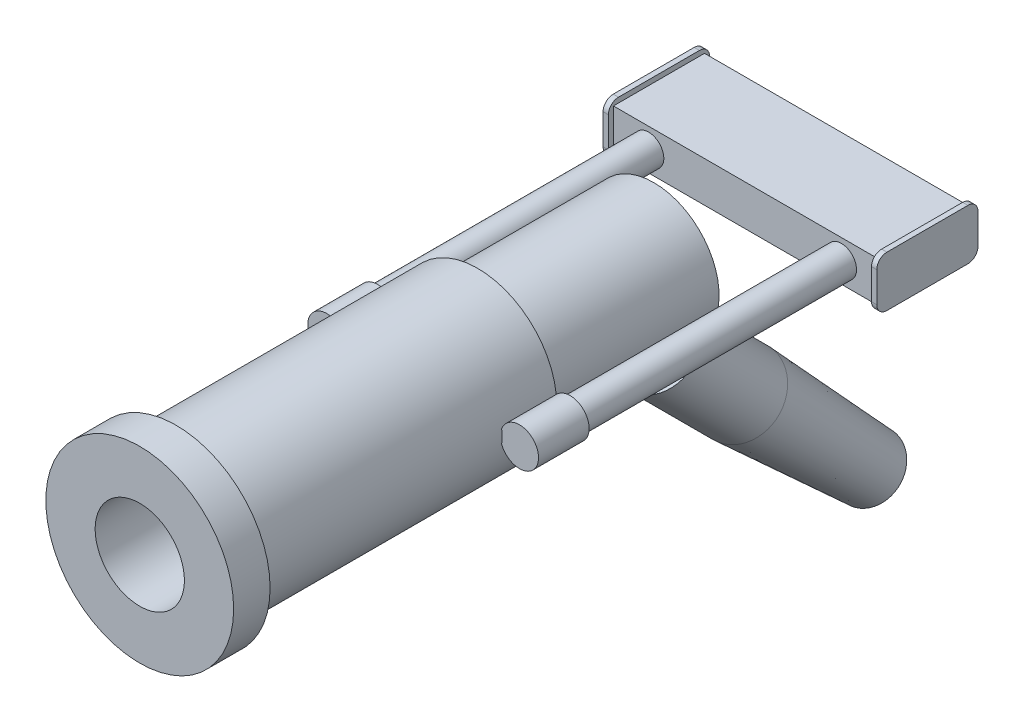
ISO-10303-21;
HEADER;
FILE_DESCRIPTION(('STEP AP214'),'2;1');
FILE_NAME('part.step','',(''),(''),'','','');
FILE_SCHEMA(('AUTOMOTIVE_DESIGN { 1 0 10303 214 1 1 1 1 }'));
ENDSEC;
DATA;
#1=APPLICATION_CONTEXT('core data for automotive mechanical design processes');
#2=APPLICATION_PROTOCOL_DEFINITION('international standard','automotive_design',2000,#1);
#3=PRODUCT_CONTEXT('',#1,'mechanical');
#4=PRODUCT('Part','Part','',(#3));
#5=PRODUCT_RELATED_PRODUCT_CATEGORY('part','',(#4));
#6=PRODUCT_DEFINITION_FORMATION('','',#4);
#7=PRODUCT_DEFINITION_CONTEXT('part definition',#1,'design');
#8=PRODUCT_DEFINITION('design','',#6,#7);
#9=PRODUCT_DEFINITION_SHAPE('','',#8);
#10=(LENGTH_UNIT() NAMED_UNIT(*) SI_UNIT(.MILLI.,.METRE.));
#11=(NAMED_UNIT(*) PLANE_ANGLE_UNIT() SI_UNIT($,.RADIAN.));
#12=(NAMED_UNIT(*) SI_UNIT($,.STERADIAN.) SOLID_ANGLE_UNIT());
#13=UNCERTAINTY_MEASURE_WITH_UNIT(LENGTH_MEASURE(1.E-05),#10,'distance_accuracy_value','');
#14=(GEOMETRIC_REPRESENTATION_CONTEXT(3) GLOBAL_UNCERTAINTY_ASSIGNED_CONTEXT((#13)) GLOBAL_UNIT_ASSIGNED_CONTEXT((#10,
#11,#12)) REPRESENTATION_CONTEXT('',''));
#15=CARTESIAN_POINT('',(0.,0.,0.));
#16=DIRECTION('',(0.,0.,1.));
#17=DIRECTION('',(1.,0.,0.));
#18=AXIS2_PLACEMENT_3D('',#15,#16,#17);
#19=CARTESIAN_POINT('',(0.,-181.25489002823,-457.75929002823));
#20=DIRECTION('',(0.,0.707106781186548,0.707106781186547));
#21=DIRECTION('',(0.,0.707106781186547,-0.707106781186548));
#22=AXIS2_PLACEMENT_3D('',#19,#20,#21);
#23=PLANE('',#22);
#24=CARTESIAN_POINT('',(0.,-181.25489002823,-457.75929002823));
#25=DIRECTION('',(0.,0.707106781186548,0.707106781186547));
#26=DIRECTION('',(0.,-0.707106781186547,0.707106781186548));
#27=AXIS2_PLACEMENT_3D('',#24,#25,#26);
#28=CIRCLE('',#27,19.1395542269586);
#29=CARTESIAN_POINT('',(0.,-194.788598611,-444.22558144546));
#30=VERTEX_POINT('',#29);
#31=EDGE_CURVE('E60',#30,#30,#28,.T.);
#32=ORIENTED_EDGE('',*,*,#31,.F.);
#33=EDGE_LOOP('',(#32));
#34=FACE_BOUND('',#33,.T.);
#35=ADVANCED_FACE('F35',(#34),#23,.F.);
#36=CARTESIAN_POINT('',(0.,-30.8356,-307.34));
#37=DIRECTION('',(0.,-0.707106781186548,-0.707106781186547));
#38=DIRECTION('',(0.,-0.707106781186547,0.707106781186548));
#39=AXIS2_PLACEMENT_3D('',#36,#37,#38);
#40=PLANE('',#39);
#41=CARTESIAN_POINT('',(0.,-30.8356,-307.34));
#42=DIRECTION('',(0.,0.707106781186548,0.707106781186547));
#43=DIRECTION('',(0.,-0.707106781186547,0.707106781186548));
#44=AXIS2_PLACEMENT_3D('',#41,#42,#43);
#45=CIRCLE('',#44,12.573);
#46=CARTESIAN_POINT('',(0.,-39.7260535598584,-298.449546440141));
#47=VERTEX_POINT('',#46);
#48=EDGE_CURVE('E11',#47,#47,#45,.T.);
#49=ORIENTED_EDGE('',*,*,#48,.T.);
#50=EDGE_LOOP('',(#49));
#51=FACE_BOUND('',#50,.T.);
#52=ADVANCED_FACE('F68',(#51),#40,.F.);
#53=CARTESIAN_POINT('',(0.,-30.8356,-307.34));
#54=DIRECTION('',(0.,-0.707106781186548,-0.707106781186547));
#55=DIRECTION('',(0.,-0.707106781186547,0.707106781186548));
#56=AXIS2_PLACEMENT_3D('',#53,#54,#55);
#57=CYLINDRICAL_SURFACE('',#56,12.573);
#58=CARTESIAN_POINT('',(0.,-44.3059841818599,-320.81038418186));
#59=DIRECTION('',(0.,0.707106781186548,0.707106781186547));
#60=DIRECTION('',(0.,-0.707106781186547,0.707106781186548));
#61=AXIS2_PLACEMENT_3D('',#58,#59,#60);
#62=CIRCLE('',#61,12.573);
#63=CARTESIAN_POINT('',(0.,-53.1964377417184,-311.919930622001));
#64=VERTEX_POINT('',#63);
#65=EDGE_CURVE('E41',#64,#64,#62,.T.);
#66=ORIENTED_EDGE('',*,*,#65,.T.);
#67=EDGE_LOOP('',(#66));
#68=FACE_BOUND('',#67,.T.);
#69=ORIENTED_EDGE('',*,*,#48,.F.);
#70=EDGE_LOOP('',(#69));
#71=FACE_BOUND('',#70,.T.);
#72=ADVANCED_FACE('F72',(#68,#71),#57,.T.);
#73=CARTESIAN_POINT('',(0.,-35.4155306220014,-329.700837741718));
#74=DIRECTION('',(0.,-0.707106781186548,-0.707106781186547));
#75=DIRECTION('',(0.,-0.707106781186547,0.707106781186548));
#76=AXIS2_PLACEMENT_3D('',#73,#74,#75);
#77=PLANE('',#76);
#78=CARTESIAN_POINT('',(0.,-44.3059841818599,-320.81038418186));
#79=DIRECTION('',(0.,0.707106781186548,0.707106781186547));
#80=DIRECTION('',(0.,-0.707106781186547,0.707106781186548));
#81=AXIS2_PLACEMENT_3D('',#78,#79,#80);
#82=CIRCLE('',#81,17.4624999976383);
#83=CARTESIAN_POINT('',(0.,-56.65383634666,-308.46253201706));
#84=VERTEX_POINT('',#83);
#85=EDGE_CURVE('E45',#84,#84,#82,.T.);
#86=ORIENTED_EDGE('',*,*,#85,.T.);
#87=EDGE_LOOP('',(#86));
#88=FACE_BOUND('',#87,.T.);
#89=ORIENTED_EDGE('',*,*,#65,.F.);
#90=EDGE_LOOP('',(#89));
#91=FACE_BOUND('',#90,.T.);
#92=ADVANCED_FACE('F76',(#88,#91),#77,.F.);
#93=CARTESIAN_POINT('',(0.,-30.8356,-307.34));
#94=DIRECTION('',(0.,-0.707106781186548,-0.707106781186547));
#95=DIRECTION('',(0.,-0.707106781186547,0.707106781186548));
#96=AXIS2_PLACEMENT_3D('',#93,#94,#95);
#97=CYLINDRICAL_SURFACE('',#96,17.4624999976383);
#98=CARTESIAN_POINT('',(0.,-46.5510482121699,-323.05544821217));
#99=DIRECTION('',(0.,0.707106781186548,0.707106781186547));
#100=DIRECTION('',(0.,-0.707106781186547,0.707106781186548));
#101=AXIS2_PLACEMENT_3D('',#98,#99,#100);
#102=CIRCLE('',#101,17.4624999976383);
#103=CARTESIAN_POINT('',(0.,-58.89890037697,-310.70759604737));
#104=VERTEX_POINT('',#103);
#105=EDGE_CURVE('E49',#104,#104,#102,.T.);
#106=ORIENTED_EDGE('',*,*,#105,.T.);
#107=EDGE_LOOP('',(#106));
#108=FACE_BOUND('',#107,.T.);
#109=ORIENTED_EDGE('',*,*,#85,.F.);
#110=EDGE_LOOP('',(#109));
#111=FACE_BOUND('',#110,.T.);
#112=ADVANCED_FACE('F81',(#108,#111),#97,.T.);
#113=CARTESIAN_POINT('',(0.,-34.2031960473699,-335.40330037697));
#114=DIRECTION('',(0.,-0.707106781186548,-0.707106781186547));
#115=DIRECTION('',(0.,-0.707106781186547,0.707106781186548));
#116=AXIS2_PLACEMENT_3D('',#113,#114,#115);
#117=PLANE('',#116);
#118=CARTESIAN_POINT('',(0.,-46.5510482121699,-323.05544821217));
#119=DIRECTION('',(0.,0.707106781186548,0.707106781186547));
#120=DIRECTION('',(0.,-0.707106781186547,0.707106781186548));
#121=AXIS2_PLACEMENT_3D('',#118,#119,#120);
#122=CIRCLE('',#121,24.1299999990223);
#123=CARTESIAN_POINT('',(0.,-63.61353484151,-305.99296158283));
#124=VERTEX_POINT('',#123);
#125=EDGE_CURVE('E54',#124,#124,#122,.T.);
#126=ORIENTED_EDGE('',*,*,#125,.T.);
#127=EDGE_LOOP('',(#126));
#128=FACE_BOUND('',#127,.T.);
#129=ORIENTED_EDGE('',*,*,#105,.F.);
#130=EDGE_LOOP('',(#129));
#131=FACE_BOUND('',#130,.T.);
#132=ADVANCED_FACE('F85',(#128,#131),#117,.F.);
#133=CARTESIAN_POINT('',(0.,-30.8356,-307.34));
#134=DIRECTION('',(0.,-0.707106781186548,-0.707106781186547));
#135=DIRECTION('',(0.,-0.707106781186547,0.707106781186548));
#136=AXIS2_PLACEMENT_3D('',#133,#134,#135);
#137=CYLINDRICAL_SURFACE('',#136,24.1299999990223);
#138=CARTESIAN_POINT('',(0.,-100.43258493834,-376.93698493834));
#139=DIRECTION('',(0.,0.707106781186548,0.707106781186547));
#140=DIRECTION('',(0.,-0.707106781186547,0.707106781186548));
#141=AXIS2_PLACEMENT_3D('',#138,#139,#140);
#142=CIRCLE('',#141,24.1299999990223);
#143=CARTESIAN_POINT('',(0.,-117.49507156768,-359.874498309));
#144=VERTEX_POINT('',#143);
#145=EDGE_CURVE('E57',#144,#144,#142,.T.);
#146=ORIENTED_EDGE('',*,*,#145,.T.);
#147=EDGE_LOOP('',(#146));
#148=FACE_BOUND('',#147,.T.);
#149=ORIENTED_EDGE('',*,*,#125,.F.);
#150=EDGE_LOOP('',(#149));
#151=FACE_BOUND('',#150,.T.);
#152=ADVANCED_FACE('F89',(#148,#151),#137,.T.);
#153=CARTESIAN_POINT('',(0.,-100.43258493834,-376.93698493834));
#154=DIRECTION('',(0.,0.707106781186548,0.707106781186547));
#155=DIRECTION('',(0.,0.707106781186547,-0.707106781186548));
#156=AXIS2_PLACEMENT_3D('',#153,#154,#155);
#157=CONICAL_SURFACE('',#156,24.1299999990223,0.0436332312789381);
#158=ORIENTED_EDGE('',*,*,#31,.T.);
#159=EDGE_LOOP('',(#158));
#160=FACE_BOUND('',#159,.T.);
#161=ORIENTED_EDGE('',*,*,#145,.F.);
#162=EDGE_LOOP('',(#161));
#163=FACE_BOUND('',#162,.T.);
#164=ADVANCED_FACE('F64',(#160,#163),#157,.T.);
#165=CLOSED_SHELL('',(#35,#52,#72,#92,#112,#132,#152,#164));
#166=MANIFOLD_SOLID_BREP('B2',#165);
#167=CARTESIAN_POINT('',(0.,0.,-322.58));
#168=DIRECTION('',(0.,0.,1.));
#169=DIRECTION('',(-1.,0.,0.));
#170=AXIS2_PLACEMENT_3D('',#167,#168,#169);
#171=CYLINDRICAL_SURFACE('',#170,40.894);
#172=CARTESIAN_POINT('',(0.,0.,-212.09));
#173=DIRECTION('',(0.,0.,1.));
#174=DIRECTION('',(1.,0.,0.));
#175=AXIS2_PLACEMENT_3D('',#172,#173,#174);
#176=CIRCLE('',#175,40.894);
#177=CARTESIAN_POINT('',(40.894,0.,-212.09));
#178=VERTEX_POINT('',#177);
#179=EDGE_CURVE('E133',#178,#178,#176,.T.);
#180=ORIENTED_EDGE('',*,*,#179,.F.);
#181=EDGE_LOOP('',(#180));
#182=FACE_BOUND('',#181,.T.);
#183=CARTESIAN_POINT('',(0.,0.,-339.344));
#184=DIRECTION('',(0.,0.707106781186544,0.707106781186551));
#185=DIRECTION('',(0.,-0.707106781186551,0.707106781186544));
#186=AXIS2_PLACEMENT_3D('',#183,#184,#185);
#187=ELLIPSE('',#186,57.8328494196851,40.894);
#188=CARTESIAN_POINT('',(37.2999670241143,-16.7639999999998,-322.58));
#189=VERTEX_POINT('',#188);
#190=CARTESIAN_POINT('',(-37.2999670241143,-16.7639999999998,-322.58));
#191=VERTEX_POINT('',#190);
#192=EDGE_CURVE('E144',#189,#191,#187,.F.);
#193=ORIENTED_EDGE('',*,*,#192,.F.);
#194=CARTESIAN_POINT('',(0.,0.,-322.58));
#195=DIRECTION('',(0.,0.,1.));
#196=DIRECTION('',(1.,0.,0.));
#197=AXIS2_PLACEMENT_3D('',#194,#195,#196);
#198=CIRCLE('',#197,40.894);
#199=EDGE_CURVE('E33',#189,#191,#198,.T.);
#200=ORIENTED_EDGE('',*,*,#199,.T.);
#201=EDGE_LOOP('',(#193,#200));
#202=FACE_BOUND('',#201,.T.);
#203=ADVANCED_FACE('F126',(#182,#202),#171,.T.);
#204=CARTESIAN_POINT('',(0.,0.,-322.58));
#205=DIRECTION('',(0.,0.,-1.));
#206=DIRECTION('',(1.,0.,0.));
#207=AXIS2_PLACEMENT_3D('',#204,#205,#206);
#208=PLANE('',#207);
#209=ORIENTED_EDGE('',*,*,#199,.F.);
#210=DIRECTION('',(-1.,0.,0.));
#211=VECTOR('',#210,1.);
#212=CARTESIAN_POINT('',(85.853,-16.7639999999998,-322.58));
#213=LINE('',#212,#211);
#214=EDGE_CURVE('E139',#189,#191,#213,.T.);
#215=ORIENTED_EDGE('',*,*,#214,.T.);
#216=EDGE_LOOP('',(#209,#215));
#217=FACE_BOUND('',#216,.T.);
#218=ADVANCED_FACE('F142',(#217),#208,.T.);
#219=CARTESIAN_POINT('',(0.,0.,-212.09));
#220=DIRECTION('',(0.,0.,-1.));
#221=DIRECTION('',(1.,0.,0.));
#222=AXIS2_PLACEMENT_3D('',#219,#220,#221);
#223=PLANE('',#222);
#224=ORIENTED_EDGE('',*,*,#179,.T.);
#225=EDGE_LOOP('',(#224));
#226=FACE_BOUND('',#225,.T.);
#227=ADVANCED_FACE('F152',(#226),#223,.F.);
#228=CARTESIAN_POINT('',(85.853,-14.7848708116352,-324.559129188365));
#229=DIRECTION('',(0.,-0.707106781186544,-0.707106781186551));
#230=DIRECTION('',(0.,-0.707106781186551,0.707106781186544));
#231=AXIS2_PLACEMENT_3D('',#228,#229,#230);
#232=PLANE('',#231);
#233=ORIENTED_EDGE('',*,*,#214,.F.);
#234=ORIENTED_EDGE('',*,*,#192,.T.);
#235=EDGE_LOOP('',(#233,#234));
#236=FACE_BOUND('',#235,.T.);
#237=ADVANCED_FACE('F147',(#236),#232,.T.);
#238=CLOSED_SHELL('',(#203,#218,#227,#237));
#239=MANIFOLD_SOLID_BREP('B6',#238);
#240=CARTESIAN_POINT('',(-60.4519999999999,0.,-209.55));
#241=DIRECTION('',(0.,0.,1.));
#242=DIRECTION('',(1.,0.,0.));
#243=AXIS2_PLACEMENT_3D('',#240,#241,#242);
#244=CYLINDRICAL_SURFACE('',#243,11.938);
#245=CARTESIAN_POINT('',(-60.4519999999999,0.,-209.55));
#246=DIRECTION('',(0.,0.,-1.));
#247=DIRECTION('',(-1.,0.,0.));
#248=AXIS2_PLACEMENT_3D('',#245,#246,#247);
#249=CIRCLE('',#248,11.938);
#250=CARTESIAN_POINT('',(-72.3899999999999,0.,-209.55));
#251=VERTEX_POINT('',#250);
#252=EDGE_CURVE('E125',#251,#251,#249,.T.);
#253=ORIENTED_EDGE('',*,*,#252,.F.);
#254=EDGE_LOOP('',(#253));
#255=FACE_BOUND('',#254,.T.);
#256=CARTESIAN_POINT('',(-60.4519999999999,0.,-177.8));
#257=DIRECTION('',(0.,0.,-1.));
#258=DIRECTION('',(-1.,0.,0.));
#259=AXIS2_PLACEMENT_3D('',#256,#257,#258);
#260=CIRCLE('',#259,11.938);
#261=CARTESIAN_POINT('',(-72.3899999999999,0.,-177.8));
#262=VERTEX_POINT('',#261);
#263=EDGE_CURVE('E184',#262,#262,#260,.T.);
#264=ORIENTED_EDGE('',*,*,#263,.T.);
#265=EDGE_LOOP('',(#264));
#266=FACE_BOUND('',#265,.T.);
#267=ADVANCED_FACE('F178',(#255,#266),#244,.T.);
#268=CARTESIAN_POINT('',(-60.4519999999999,0.,-209.55));
#269=DIRECTION('',(0.,0.,-1.));
#270=DIRECTION('',(-1.,0.,0.));
#271=AXIS2_PLACEMENT_3D('',#268,#269,#270);
#272=PLANE('',#271);
#273=ORIENTED_EDGE('',*,*,#252,.T.);
#274=EDGE_LOOP('',(#273));
#275=FACE_BOUND('',#274,.T.);
#276=ADVANCED_FACE('F193',(#275),#272,.T.);
#277=CARTESIAN_POINT('',(-60.4519999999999,0.,-177.8));
#278=DIRECTION('',(0.,0.,-1.));
#279=DIRECTION('',(-1.,0.,0.));
#280=AXIS2_PLACEMENT_3D('',#277,#278,#279);
#281=PLANE('',#280);
#282=ORIENTED_EDGE('',*,*,#263,.F.);
#283=EDGE_LOOP('',(#282));
#284=FACE_BOUND('',#283,.T.);
#285=ADVANCED_FACE('F191',(#284),#281,.F.);
#286=CLOSED_SHELL('',(#267,#276,#285));
#287=MANIFOLD_SOLID_BREP('B27',#286);
#288=CARTESIAN_POINT('',(-60.4519999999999,0.,-379.73));
#289=DIRECTION('',(0.,0.,1.));
#290=DIRECTION('',(1.,0.,0.));
#291=AXIS2_PLACEMENT_3D('',#288,#289,#290);
#292=CYLINDRICAL_SURFACE('',#291,9.52500000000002);
#293=CARTESIAN_POINT('',(-60.4519999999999,0.,-379.73));
#294=DIRECTION('',(0.,0.,-1.));
#295=DIRECTION('',(-1.,0.,0.));
#296=AXIS2_PLACEMENT_3D('',#293,#294,#295);
#297=CIRCLE('',#296,9.52500000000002);
#298=CARTESIAN_POINT('',(-69.977,0.,-379.73));
#299=VERTEX_POINT('',#298);
#300=EDGE_CURVE('E177',#299,#299,#297,.T.);
#301=ORIENTED_EDGE('',*,*,#300,.F.);
#302=EDGE_LOOP('',(#301));
#303=FACE_BOUND('',#302,.T.);
#304=CARTESIAN_POINT('',(-60.4519999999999,0.,-209.55));
#305=DIRECTION('',(0.,0.,-1.));
#306=DIRECTION('',(-1.,0.,0.));
#307=AXIS2_PLACEMENT_3D('',#304,#305,#306);
#308=CIRCLE('',#307,9.52500000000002);
#309=CARTESIAN_POINT('',(-69.977,0.,-209.55));
#310=VERTEX_POINT('',#309);
#311=EDGE_CURVE('E222',#310,#310,#308,.T.);
#312=ORIENTED_EDGE('',*,*,#311,.T.);
#313=EDGE_LOOP('',(#312));
#314=FACE_BOUND('',#313,.T.);
#315=ADVANCED_FACE('F216',(#303,#314),#292,.T.);
#316=CARTESIAN_POINT('',(-60.4519999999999,0.,-379.73));
#317=DIRECTION('',(0.,0.,-1.));
#318=DIRECTION('',(-1.,0.,0.));
#319=AXIS2_PLACEMENT_3D('',#316,#317,#318);
#320=PLANE('',#319);
#321=ORIENTED_EDGE('',*,*,#300,.T.);
#322=EDGE_LOOP('',(#321));
#323=FACE_BOUND('',#322,.T.);
#324=ADVANCED_FACE('F231',(#323),#320,.T.);
#325=CARTESIAN_POINT('',(-60.4519999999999,0.,-209.55));
#326=DIRECTION('',(0.,0.,-1.));
#327=DIRECTION('',(-1.,0.,0.));
#328=AXIS2_PLACEMENT_3D('',#325,#326,#327);
#329=PLANE('',#328);
#330=ORIENTED_EDGE('',*,*,#311,.F.);
#331=EDGE_LOOP('',(#330));
#332=FACE_BOUND('',#331,.T.);
#333=ADVANCED_FACE('F229',(#332),#329,.F.);
#334=CLOSED_SHELL('',(#315,#324,#333));
#335=MANIFOLD_SOLID_BREP('B120',#334);
#336=CARTESIAN_POINT('',(-85.852,9.52500000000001,-433.705));
#337=DIRECTION('',(1.,0.,0.));
#338=DIRECTION('',(0.,0.,-1.));
#339=AXIS2_PLACEMENT_3D('',#336,#337,#338);
#340=CYLINDRICAL_SURFACE('',#339,6.34999999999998);
#341=CARTESIAN_POINT('',(-82.5500000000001,9.52500000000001,-433.705));
#342=DIRECTION('',(-1.,0.,0.));
#343=DIRECTION('',(0.,0.,-1.));
#344=AXIS2_PLACEMENT_3D('',#341,#342,#343);
#345=CIRCLE('',#344,6.34999999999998);
#346=CARTESIAN_POINT('',(-82.5500000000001,15.875,-433.705));
#347=VERTEX_POINT('',#346);
#348=CARTESIAN_POINT('',(-82.5500000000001,9.52500000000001,-440.055));
#349=VERTEX_POINT('',#348);
#350=EDGE_CURVE('E320',#347,#349,#345,.T.);
#351=ORIENTED_EDGE('',*,*,#350,.T.);
#352=DIRECTION('',(1.,0.,0.));
#353=VECTOR('',#352,1.);
#354=CARTESIAN_POINT('',(-85.852,9.52500000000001,-440.055));
#355=LINE('',#354,#353);
#356=CARTESIAN_POINT('',(-85.852,9.52500000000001,-440.055));
#357=VERTEX_POINT('',#356);
#358=EDGE_CURVE('E214',#357,#349,#355,.T.);
#359=ORIENTED_EDGE('',*,*,#358,.F.);
#360=CARTESIAN_POINT('',(-85.852,9.52500000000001,-433.705));
#361=DIRECTION('',(-1.,0.,0.));
#362=DIRECTION('',(0.,0.,-1.));
#363=AXIS2_PLACEMENT_3D('',#360,#361,#362);
#364=CIRCLE('',#363,6.34999999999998);
#365=CARTESIAN_POINT('',(-85.852,15.875,-433.705));
#366=VERTEX_POINT('',#365);
#367=EDGE_CURVE('E352',#366,#357,#364,.T.);
#368=ORIENTED_EDGE('',*,*,#367,.F.);
#369=DIRECTION('',(1.,0.,0.));
#370=VECTOR('',#369,1.);
#371=CARTESIAN_POINT('',(-85.852,15.875,-433.705));
#372=LINE('',#371,#370);
#373=EDGE_CURVE('E334',#366,#347,#372,.T.);
#374=ORIENTED_EDGE('',*,*,#373,.T.);
#375=EDGE_LOOP('',(#351,#359,#368,#374));
#376=FACE_BOUND('',#375,.T.);
#377=ADVANCED_FACE('F254',(#376),#340,.T.);
#378=CARTESIAN_POINT('',(-85.852,9.52500000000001,-440.055));
#379=DIRECTION('',(0.,0.,1.));
#380=DIRECTION('',(1.,0.,0.));
#381=AXIS2_PLACEMENT_3D('',#378,#379,#380);
#382=PLANE('',#381);
#383=DIRECTION('',(0.,-1.,0.));
#384=VECTOR('',#383,1.);
#385=CARTESIAN_POINT('',(-82.5500000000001,9.52500000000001,-440.055));
#386=LINE('',#385,#384);
#387=CARTESIAN_POINT('',(-82.5500000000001,-9.52500000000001,-440.055));
#388=VERTEX_POINT('',#387);
#389=EDGE_CURVE('E317',#349,#388,#386,.T.);
#390=ORIENTED_EDGE('',*,*,#389,.T.);
#391=DIRECTION('',(1.,0.,0.));
#392=VECTOR('',#391,1.);
#393=CARTESIAN_POINT('',(-85.852,-9.52500000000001,-440.055));
#394=LINE('',#393,#392);
#395=CARTESIAN_POINT('',(-85.852,-9.52500000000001,-440.055));
#396=VERTEX_POINT('',#395);
#397=EDGE_CURVE('E261',#396,#388,#394,.T.);
#398=ORIENTED_EDGE('',*,*,#397,.F.);
#399=DIRECTION('',(0.,-1.,0.));
#400=VECTOR('',#399,1.);
#401=CARTESIAN_POINT('',(-85.852,9.52500000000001,-440.055));
#402=LINE('',#401,#400);
#403=EDGE_CURVE('E330',#357,#396,#402,.T.);
#404=ORIENTED_EDGE('',*,*,#403,.F.);
#405=ORIENTED_EDGE('',*,*,#358,.T.);
#406=EDGE_LOOP('',(#390,#398,#404,#405));
#407=FACE_BOUND('',#406,.T.);
#408=ADVANCED_FACE('F328',(#407),#382,.F.);
#409=CARTESIAN_POINT('',(-85.852,-9.52500000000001,-433.705));
#410=DIRECTION('',(1.,0.,0.));
#411=DIRECTION('',(0.,0.,-1.));
#412=AXIS2_PLACEMENT_3D('',#409,#410,#411);
#413=CYLINDRICAL_SURFACE('',#412,6.34999999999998);
#414=CARTESIAN_POINT('',(-82.5500000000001,-9.52500000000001,-433.705));
#415=DIRECTION('',(-1.,0.,0.));
#416=DIRECTION('',(0.,0.,1.));
#417=AXIS2_PLACEMENT_3D('',#414,#415,#416);
#418=CIRCLE('',#417,6.34999999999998);
#419=CARTESIAN_POINT('',(-82.5500000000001,-15.875,-433.705));
#420=VERTEX_POINT('',#419);
#421=EDGE_CURVE('E322',#388,#420,#418,.T.);
#422=ORIENTED_EDGE('',*,*,#421,.T.);
#423=DIRECTION('',(1.,0.,0.));
#424=VECTOR('',#423,1.);
#425=CARTESIAN_POINT('',(-85.852,-15.875,-433.705));
#426=LINE('',#425,#424);
#427=CARTESIAN_POINT('',(-85.852,-15.875,-433.705));
#428=VERTEX_POINT('',#427);
#429=EDGE_CURVE('E382',#428,#420,#426,.T.);
#430=ORIENTED_EDGE('',*,*,#429,.F.);
#431=CARTESIAN_POINT('',(-85.852,-9.52500000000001,-433.705));
#432=DIRECTION('',(-1.,0.,0.));
#433=DIRECTION('',(0.,0.,1.));
#434=AXIS2_PLACEMENT_3D('',#431,#432,#433);
#435=CIRCLE('',#434,6.34999999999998);
#436=EDGE_CURVE('E355',#396,#428,#435,.T.);
#437=ORIENTED_EDGE('',*,*,#436,.F.);
#438=ORIENTED_EDGE('',*,*,#397,.T.);
#439=EDGE_LOOP('',(#422,#430,#437,#438));
#440=FACE_BOUND('',#439,.T.);
#441=ADVANCED_FACE('F385',(#440),#413,.T.);
#442=CARTESIAN_POINT('',(-85.852,-15.875,-433.705));
#443=DIRECTION('',(0.,1.,0.));
#444=DIRECTION('',(0.,0.,-1.));
#445=AXIS2_PLACEMENT_3D('',#442,#443,#444);
#446=PLANE('',#445);
#447=DIRECTION('',(0.,0.,1.));
#448=VECTOR('',#447,1.);
#449=CARTESIAN_POINT('',(-82.5500000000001,-15.875,-433.705));
#450=LINE('',#449,#448);
#451=CARTESIAN_POINT('',(-82.5500000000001,-15.875,-382.905));
#452=VERTEX_POINT('',#451);
#453=EDGE_CURVE('E338',#420,#452,#450,.T.);
#454=ORIENTED_EDGE('',*,*,#453,.T.);
#455=DIRECTION('',(1.,0.,0.));
#456=VECTOR('',#455,1.);
#457=CARTESIAN_POINT('',(-85.852,-15.875,-382.905));
#458=LINE('',#457,#456);
#459=CARTESIAN_POINT('',(-85.852,-15.875,-382.905));
#460=VERTEX_POINT('',#459);
#461=EDGE_CURVE('E379',#460,#452,#458,.T.);
#462=ORIENTED_EDGE('',*,*,#461,.F.);
#463=DIRECTION('',(0.,0.,1.));
#464=VECTOR('',#463,1.);
#465=CARTESIAN_POINT('',(-85.852,-15.875,-433.705));
#466=LINE('',#465,#464);
#467=EDGE_CURVE('E358',#428,#460,#466,.T.);
#468=ORIENTED_EDGE('',*,*,#467,.F.);
#469=ORIENTED_EDGE('',*,*,#429,.T.);
#470=EDGE_LOOP('',(#454,#462,#468,#469));
#471=FACE_BOUND('',#470,.T.);
#472=ADVANCED_FACE('F405',(#471),#446,.F.);
#473=CARTESIAN_POINT('',(-85.852,-9.52500000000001,-382.905));
#474=DIRECTION('',(1.,0.,0.));
#475=DIRECTION('',(0.,0.,-1.));
#476=AXIS2_PLACEMENT_3D('',#473,#474,#475);
#477=CYLINDRICAL_SURFACE('',#476,6.35000000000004);
#478=CARTESIAN_POINT('',(-82.5500000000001,-9.52500000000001,-382.905));
#479=DIRECTION('',(-1.,0.,0.));
#480=DIRECTION('',(0.,0.,-1.));
#481=AXIS2_PLACEMENT_3D('',#478,#479,#480);
#482=CIRCLE('',#481,6.35000000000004);
#483=CARTESIAN_POINT('',(-82.5500000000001,-9.52500000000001,-376.555));
#484=VERTEX_POINT('',#483);
#485=EDGE_CURVE('E341',#452,#484,#482,.T.);
#486=ORIENTED_EDGE('',*,*,#485,.T.);
#487=DIRECTION('',(1.,0.,0.));
#488=VECTOR('',#487,1.);
#489=CARTESIAN_POINT('',(-85.852,-9.52500000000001,-376.555));
#490=LINE('',#489,#488);
#491=CARTESIAN_POINT('',(-85.852,-9.52500000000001,-376.555));
#492=VERTEX_POINT('',#491);
#493=EDGE_CURVE('E376',#492,#484,#490,.T.);
#494=ORIENTED_EDGE('',*,*,#493,.F.);
#495=CARTESIAN_POINT('',(-85.852,-9.52500000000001,-382.905));
#496=DIRECTION('',(-1.,0.,0.));
#497=DIRECTION('',(0.,0.,-1.));
#498=AXIS2_PLACEMENT_3D('',#495,#496,#497);
#499=CIRCLE('',#498,6.35000000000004);
#500=EDGE_CURVE('E361',#460,#492,#499,.T.);
#501=ORIENTED_EDGE('',*,*,#500,.F.);
#502=ORIENTED_EDGE('',*,*,#461,.T.);
#503=EDGE_LOOP('',(#486,#494,#501,#502));
#504=FACE_BOUND('',#503,.T.);
#505=ADVANCED_FACE('F410',(#504),#477,.T.);
#506=CARTESIAN_POINT('',(-85.852,-9.52500000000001,-376.555));
#507=DIRECTION('',(0.,0.,-1.));
#508=DIRECTION('',(-1.,0.,0.));
#509=AXIS2_PLACEMENT_3D('',#506,#507,#508);
#510=PLANE('',#509);
#511=DIRECTION('',(0.,1.,0.));
#512=VECTOR('',#511,1.);
#513=CARTESIAN_POINT('',(-82.5500000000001,-9.52500000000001,-376.555));
#514=LINE('',#513,#512);
#515=CARTESIAN_POINT('',(-82.5500000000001,9.52500000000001,-376.555));
#516=VERTEX_POINT('',#515);
#517=EDGE_CURVE('E344',#484,#516,#514,.T.);
#518=ORIENTED_EDGE('',*,*,#517,.T.);
#519=DIRECTION('',(1.,0.,0.));
#520=VECTOR('',#519,1.);
#521=CARTESIAN_POINT('',(-85.852,9.52500000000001,-376.555));
#522=LINE('',#521,#520);
#523=CARTESIAN_POINT('',(-85.852,9.52500000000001,-376.555));
#524=VERTEX_POINT('',#523);
#525=EDGE_CURVE('E373',#524,#516,#522,.T.);
#526=ORIENTED_EDGE('',*,*,#525,.F.);
#527=DIRECTION('',(0.,1.,0.));
#528=VECTOR('',#527,1.);
#529=CARTESIAN_POINT('',(-85.852,-9.52500000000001,-376.555));
#530=LINE('',#529,#528);
#531=EDGE_CURVE('E364',#492,#524,#530,.T.);
#532=ORIENTED_EDGE('',*,*,#531,.F.);
#533=ORIENTED_EDGE('',*,*,#493,.T.);
#534=EDGE_LOOP('',(#518,#526,#532,#533));
#535=FACE_BOUND('',#534,.T.);
#536=ADVANCED_FACE('F414',(#535),#510,.F.);
#537=CARTESIAN_POINT('',(-85.852,9.52500000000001,-382.905));
#538=DIRECTION('',(1.,0.,0.));
#539=DIRECTION('',(0.,0.,-1.));
#540=AXIS2_PLACEMENT_3D('',#537,#538,#539);
#541=CYLINDRICAL_SURFACE('',#540,6.35000000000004);
#542=CARTESIAN_POINT('',(-82.5500000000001,9.52500000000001,-382.905));
#543=DIRECTION('',(-1.,0.,0.));
#544=DIRECTION('',(0.,0.,-1.));
#545=AXIS2_PLACEMENT_3D('',#542,#543,#544);
#546=CIRCLE('',#545,6.35000000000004);
#547=CARTESIAN_POINT('',(-82.5500000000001,15.8750000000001,-382.905));
#548=VERTEX_POINT('',#547);
#549=EDGE_CURVE('E347',#516,#548,#546,.T.);
#550=ORIENTED_EDGE('',*,*,#549,.T.);
#551=DIRECTION('',(1.,0.,0.));
#552=VECTOR('',#551,1.);
#553=CARTESIAN_POINT('',(-85.852,15.8750000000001,-382.905));
#554=LINE('',#553,#552);
#555=CARTESIAN_POINT('',(-85.852,15.8750000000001,-382.905));
#556=VERTEX_POINT('',#555);
#557=EDGE_CURVE('E371',#556,#548,#554,.T.);
#558=ORIENTED_EDGE('',*,*,#557,.F.);
#559=CARTESIAN_POINT('',(-85.852,9.52500000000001,-382.905));
#560=DIRECTION('',(-1.,0.,0.));
#561=DIRECTION('',(0.,0.,-1.));
#562=AXIS2_PLACEMENT_3D('',#559,#560,#561);
#563=CIRCLE('',#562,6.35000000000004);
#564=EDGE_CURVE('E367',#524,#556,#563,.T.);
#565=ORIENTED_EDGE('',*,*,#564,.F.);
#566=ORIENTED_EDGE('',*,*,#525,.T.);
#567=EDGE_LOOP('',(#550,#558,#565,#566));
#568=FACE_BOUND('',#567,.T.);
#569=ADVANCED_FACE('F396',(#568),#541,.T.);
#570=CARTESIAN_POINT('',(-85.852,15.875,-382.905));
#571=DIRECTION('',(0.,-1.,0.));
#572=DIRECTION('',(0.,0.,1.));
#573=AXIS2_PLACEMENT_3D('',#570,#571,#572);
#574=PLANE('',#573);
#575=DIRECTION('',(0.,0.,-1.));
#576=VECTOR('',#575,1.);
#577=CARTESIAN_POINT('',(-82.5500000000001,15.875,-382.905));
#578=LINE('',#577,#576);
#579=EDGE_CURVE('E350',#548,#347,#578,.T.);
#580=ORIENTED_EDGE('',*,*,#579,.T.);
#581=ORIENTED_EDGE('',*,*,#373,.F.);
#582=DIRECTION('',(0.,0.,-1.));
#583=VECTOR('',#582,1.);
#584=CARTESIAN_POINT('',(-85.852,15.875,-382.905));
#585=LINE('',#584,#583);
#586=EDGE_CURVE('E268',#556,#366,#585,.T.);
#587=ORIENTED_EDGE('',*,*,#586,.F.);
#588=ORIENTED_EDGE('',*,*,#557,.T.);
#589=EDGE_LOOP('',(#580,#581,#587,#588));
#590=FACE_BOUND('',#589,.T.);
#591=ADVANCED_FACE('F389',(#590),#574,.F.);
#592=CARTESIAN_POINT('',(-85.852,9.52500000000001,-433.705));
#593=DIRECTION('',(1.,0.,0.));
#594=DIRECTION('',(0.,0.,-1.));
#595=AXIS2_PLACEMENT_3D('',#592,#593,#594);
#596=PLANE('',#595);
#597=ORIENTED_EDGE('',*,*,#367,.T.);
#598=ORIENTED_EDGE('',*,*,#403,.T.);
#599=ORIENTED_EDGE('',*,*,#436,.T.);
#600=ORIENTED_EDGE('',*,*,#467,.T.);
#601=ORIENTED_EDGE('',*,*,#500,.T.);
#602=ORIENTED_EDGE('',*,*,#531,.T.);
#603=ORIENTED_EDGE('',*,*,#564,.T.);
#604=ORIENTED_EDGE('',*,*,#586,.T.);
#605=EDGE_LOOP('',(#597,#598,#599,#600,#601,#602,#603,#604));
#606=FACE_BOUND('',#605,.T.);
#607=ADVANCED_FACE('F387',(#606),#596,.F.);
#608=CARTESIAN_POINT('',(-82.5500000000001,9.52500000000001,-433.705));
#609=DIRECTION('',(1.,0.,0.));
#610=DIRECTION('',(0.,0.,-1.));
#611=AXIS2_PLACEMENT_3D('',#608,#609,#610);
#612=PLANE('',#611);
#613=ORIENTED_EDGE('',*,*,#350,.F.);
#614=ORIENTED_EDGE('',*,*,#579,.F.);
#615=ORIENTED_EDGE('',*,*,#549,.F.);
#616=ORIENTED_EDGE('',*,*,#517,.F.);
#617=ORIENTED_EDGE('',*,*,#485,.F.);
#618=ORIENTED_EDGE('',*,*,#453,.F.);
#619=ORIENTED_EDGE('',*,*,#421,.F.);
#620=ORIENTED_EDGE('',*,*,#389,.F.);
#621=EDGE_LOOP('',(#613,#614,#615,#616,#617,#618,#619,#620));
#622=FACE_BOUND('',#621,.T.);
#623=ADVANCED_FACE('F318',(#622),#612,.T.);
#624=CLOSED_SHELL('',(#377,#408,#441,#472,#505,#536,#569,#591,#607,#623));
#625=MANIFOLD_SOLID_BREP('B172',#624);
#626=CARTESIAN_POINT('',(85.852,9.52500000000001,-433.705));
#627=DIRECTION('',(-1.,0.,0.));
#628=DIRECTION('',(0.,0.,-1.));
#629=AXIS2_PLACEMENT_3D('',#626,#627,#628);
#630=CYLINDRICAL_SURFACE('',#629,6.34999999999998);
#631=CARTESIAN_POINT('',(82.5500000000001,9.52500000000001,-433.705));
#632=DIRECTION('',(-1.,0.,0.));
#633=DIRECTION('',(0.,0.,-1.));
#634=AXIS2_PLACEMENT_3D('',#631,#632,#633);
#635=CIRCLE('',#634,6.34999999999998);
#636=CARTESIAN_POINT('',(82.5500000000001,15.875,-433.705));
#637=VERTEX_POINT('',#636);
#638=CARTESIAN_POINT('',(82.5500000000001,9.52500000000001,-440.055));
#639=VERTEX_POINT('',#638);
#640=EDGE_CURVE('E523',#637,#639,#635,.T.);
#641=ORIENTED_EDGE('',*,*,#640,.F.);
#642=DIRECTION('',(-1.,0.,0.));
#643=VECTOR('',#642,1.);
#644=CARTESIAN_POINT('',(85.852,15.875,-433.705));
#645=LINE('',#644,#643);
#646=CARTESIAN_POINT('',(85.852,15.875,-433.705));
#647=VERTEX_POINT('',#646);
#648=EDGE_CURVE('E566',#647,#637,#645,.T.);
#649=ORIENTED_EDGE('',*,*,#648,.F.);
#650=CARTESIAN_POINT('',(85.852,9.52500000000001,-433.705));
#651=DIRECTION('',(-1.,0.,0.));
#652=DIRECTION('',(0.,0.,-1.));
#653=AXIS2_PLACEMENT_3D('',#650,#651,#652);
#654=CIRCLE('',#653,6.34999999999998);
#655=CARTESIAN_POINT('',(85.852,9.52500000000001,-440.055));
#656=VERTEX_POINT('',#655);
#657=EDGE_CURVE('E528',#647,#656,#654,.T.);
#658=ORIENTED_EDGE('',*,*,#657,.T.);
#659=DIRECTION('',(-1.,0.,0.));
#660=VECTOR('',#659,1.);
#661=CARTESIAN_POINT('',(85.852,9.52500000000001,-440.055));
#662=LINE('',#661,#660);
#663=EDGE_CURVE('E252',#656,#639,#662,.T.);
#664=ORIENTED_EDGE('',*,*,#663,.T.);
#665=EDGE_LOOP('',(#641,#649,#658,#664));
#666=FACE_BOUND('',#665,.T.);
#667=ADVANCED_FACE('F451',(#666),#630,.T.);
#668=CARTESIAN_POINT('',(85.852,9.52500000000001,-440.055));
#669=DIRECTION('',(0.,0.,1.));
#670=DIRECTION('',(-1.,0.,0.));
#671=AXIS2_PLACEMENT_3D('',#668,#669,#670);
#672=PLANE('',#671);
#673=DIRECTION('',(0.,-1.,0.));
#674=VECTOR('',#673,1.);
#675=CARTESIAN_POINT('',(82.5500000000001,9.52500000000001,-440.055));
#676=LINE('',#675,#674);
#677=CARTESIAN_POINT('',(82.5500000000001,-9.52500000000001,-440.055));
#678=VERTEX_POINT('',#677);
#679=EDGE_CURVE('E514',#639,#678,#676,.T.);
#680=ORIENTED_EDGE('',*,*,#679,.F.);
#681=ORIENTED_EDGE('',*,*,#663,.F.);
#682=DIRECTION('',(0.,-1.,0.));
#683=VECTOR('',#682,1.);
#684=CARTESIAN_POINT('',(85.852,9.52500000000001,-440.055));
#685=LINE('',#684,#683);
#686=CARTESIAN_POINT('',(85.852,-9.52500000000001,-440.055));
#687=VERTEX_POINT('',#686);
#688=EDGE_CURVE('E548',#656,#687,#685,.T.);
#689=ORIENTED_EDGE('',*,*,#688,.T.);
#690=DIRECTION('',(-1.,0.,0.));
#691=VECTOR('',#690,1.);
#692=CARTESIAN_POINT('',(85.852,-9.52500000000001,-440.055));
#693=LINE('',#692,#691);
#694=EDGE_CURVE('E458',#687,#678,#693,.T.);
#695=ORIENTED_EDGE('',*,*,#694,.T.);
#696=EDGE_LOOP('',(#680,#681,#689,#695));
#697=FACE_BOUND('',#696,.T.);
#698=ADVANCED_FACE('F515',(#697),#672,.F.);
#699=CARTESIAN_POINT('',(85.852,-9.52500000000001,-433.705));
#700=DIRECTION('',(-1.,0.,0.));
#701=DIRECTION('',(0.,0.,-1.));
#702=AXIS2_PLACEMENT_3D('',#699,#700,#701);
#703=CYLINDRICAL_SURFACE('',#702,6.34999999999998);
#704=CARTESIAN_POINT('',(82.5500000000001,-9.52500000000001,-433.705));
#705=DIRECTION('',(-1.,0.,0.));
#706=DIRECTION('',(0.,0.,1.));
#707=AXIS2_PLACEMENT_3D('',#704,#705,#706);
#708=CIRCLE('',#707,6.34999999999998);
#709=CARTESIAN_POINT('',(82.5500000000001,-15.875,-433.705));
#710=VERTEX_POINT('',#709);
#711=EDGE_CURVE('E522',#678,#710,#708,.T.);
#712=ORIENTED_EDGE('',*,*,#711,.F.);
#713=ORIENTED_EDGE('',*,*,#694,.F.);
#714=CARTESIAN_POINT('',(85.852,-9.52500000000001,-433.705));
#715=DIRECTION('',(-1.,0.,0.));
#716=DIRECTION('',(0.,0.,1.));
#717=AXIS2_PLACEMENT_3D('',#714,#715,#716);
#718=CIRCLE('',#717,6.34999999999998);
#719=CARTESIAN_POINT('',(85.852,-15.875,-433.705));
#720=VERTEX_POINT('',#719);
#721=EDGE_CURVE('E550',#687,#720,#718,.T.);
#722=ORIENTED_EDGE('',*,*,#721,.T.);
#723=DIRECTION('',(-1.,0.,0.));
#724=VECTOR('',#723,1.);
#725=CARTESIAN_POINT('',(85.852,-15.875,-433.705));
#726=LINE('',#725,#724);
#727=EDGE_CURVE('E580',#720,#710,#726,.T.);
#728=ORIENTED_EDGE('',*,*,#727,.T.);
#729=EDGE_LOOP('',(#712,#713,#722,#728));
#730=FACE_BOUND('',#729,.T.);
#731=ADVANCED_FACE('F584',(#730),#703,.T.);
#732=CARTESIAN_POINT('',(85.852,-15.875,-433.705));
#733=DIRECTION('',(0.,1.,0.));
#734=DIRECTION('',(0.,0.,-1.));
#735=AXIS2_PLACEMENT_3D('',#732,#733,#734);
#736=PLANE('',#735);
#737=DIRECTION('',(0.,0.,1.));
#738=VECTOR('',#737,1.);
#739=CARTESIAN_POINT('',(82.5500000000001,-15.875,-433.705));
#740=LINE('',#739,#738);
#741=CARTESIAN_POINT('',(82.5500000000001,-15.875,-382.905));
#742=VERTEX_POINT('',#741);
#743=EDGE_CURVE('E535',#710,#742,#740,.T.);
#744=ORIENTED_EDGE('',*,*,#743,.F.);
#745=ORIENTED_EDGE('',*,*,#727,.F.);
#746=DIRECTION('',(0.,0.,1.));
#747=VECTOR('',#746,1.);
#748=CARTESIAN_POINT('',(85.852,-15.875,-433.705));
#749=LINE('',#748,#747);
#750=CARTESIAN_POINT('',(85.852,-15.875,-382.905));
#751=VERTEX_POINT('',#750);
#752=EDGE_CURVE('E553',#720,#751,#749,.T.);
#753=ORIENTED_EDGE('',*,*,#752,.T.);
#754=DIRECTION('',(-1.,0.,0.));
#755=VECTOR('',#754,1.);
#756=CARTESIAN_POINT('',(85.852,-15.875,-382.905));
#757=LINE('',#756,#755);
#758=EDGE_CURVE('E577',#751,#742,#757,.T.);
#759=ORIENTED_EDGE('',*,*,#758,.T.);
#760=EDGE_LOOP('',(#744,#745,#753,#759));
#761=FACE_BOUND('',#760,.T.);
#762=ADVANCED_FACE('F586',(#761),#736,.F.);
#763=CARTESIAN_POINT('',(85.852,-9.52500000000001,-382.905));
#764=DIRECTION('',(-1.,0.,0.));
#765=DIRECTION('',(0.,0.,-1.));
#766=AXIS2_PLACEMENT_3D('',#763,#764,#765);
#767=CYLINDRICAL_SURFACE('',#766,6.35000000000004);
#768=CARTESIAN_POINT('',(82.5500000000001,-9.52500000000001,-382.905));
#769=DIRECTION('',(-1.,0.,0.));
#770=DIRECTION('',(0.,0.,-1.));
#771=AXIS2_PLACEMENT_3D('',#768,#769,#770);
#772=CIRCLE('',#771,6.35000000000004);
#773=CARTESIAN_POINT('',(82.5500000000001,-9.52500000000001,-376.555));
#774=VERTEX_POINT('',#773);
#775=EDGE_CURVE('E538',#742,#774,#772,.T.);
#776=ORIENTED_EDGE('',*,*,#775,.F.);
#777=ORIENTED_EDGE('',*,*,#758,.F.);
#778=CARTESIAN_POINT('',(85.852,-9.52500000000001,-382.905));
#779=DIRECTION('',(-1.,0.,0.));
#780=DIRECTION('',(0.,0.,-1.));
#781=AXIS2_PLACEMENT_3D('',#778,#779,#780);
#782=CIRCLE('',#781,6.35000000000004);
#783=CARTESIAN_POINT('',(85.852,-9.52500000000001,-376.555));
#784=VERTEX_POINT('',#783);
#785=EDGE_CURVE('E556',#751,#784,#782,.T.);
#786=ORIENTED_EDGE('',*,*,#785,.T.);
#787=DIRECTION('',(-1.,0.,0.));
#788=VECTOR('',#787,1.);
#789=CARTESIAN_POINT('',(85.852,-9.52500000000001,-376.555));
#790=LINE('',#789,#788);
#791=EDGE_CURVE('E574',#784,#774,#790,.T.);
#792=ORIENTED_EDGE('',*,*,#791,.T.);
#793=EDGE_LOOP('',(#776,#777,#786,#792));
#794=FACE_BOUND('',#793,.T.);
#795=ADVANCED_FACE('F589',(#794),#767,.T.);
#796=CARTESIAN_POINT('',(85.852,-9.52500000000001,-376.555));
#797=DIRECTION('',(0.,0.,-1.));
#798=DIRECTION('',(1.,0.,0.));
#799=AXIS2_PLACEMENT_3D('',#796,#797,#798);
#800=PLANE('',#799);
#801=DIRECTION('',(0.,1.,0.));
#802=VECTOR('',#801,1.);
#803=CARTESIAN_POINT('',(82.5500000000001,-9.52500000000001,-376.555));
#804=LINE('',#803,#802);
#805=CARTESIAN_POINT('',(82.5500000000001,9.52500000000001,-376.555));
#806=VERTEX_POINT('',#805);
#807=EDGE_CURVE('E541',#774,#806,#804,.T.);
#808=ORIENTED_EDGE('',*,*,#807,.F.);
#809=ORIENTED_EDGE('',*,*,#791,.F.);
#810=DIRECTION('',(0.,1.,0.));
#811=VECTOR('',#810,1.);
#812=CARTESIAN_POINT('',(85.852,-9.52500000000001,-376.555));
#813=LINE('',#812,#811);
#814=CARTESIAN_POINT('',(85.852,9.52500000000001,-376.555));
#815=VERTEX_POINT('',#814);
#816=EDGE_CURVE('E559',#784,#815,#813,.T.);
#817=ORIENTED_EDGE('',*,*,#816,.T.);
#818=DIRECTION('',(-1.,0.,0.));
#819=VECTOR('',#818,1.);
#820=CARTESIAN_POINT('',(85.852,9.52500000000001,-376.555));
#821=LINE('',#820,#819);
#822=EDGE_CURVE('E571',#815,#806,#821,.T.);
#823=ORIENTED_EDGE('',*,*,#822,.T.);
#824=EDGE_LOOP('',(#808,#809,#817,#823));
#825=FACE_BOUND('',#824,.T.);
#826=ADVANCED_FACE('F592',(#825),#800,.F.);
#827=CARTESIAN_POINT('',(85.852,9.52500000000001,-382.905));
#828=DIRECTION('',(-1.,0.,0.));
#829=DIRECTION('',(0.,0.,-1.));
#830=AXIS2_PLACEMENT_3D('',#827,#828,#829);
#831=CYLINDRICAL_SURFACE('',#830,6.35000000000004);
#832=CARTESIAN_POINT('',(82.5500000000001,9.52500000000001,-382.905));
#833=DIRECTION('',(-1.,0.,0.));
#834=DIRECTION('',(0.,0.,-1.));
#835=AXIS2_PLACEMENT_3D('',#832,#833,#834);
#836=CIRCLE('',#835,6.35000000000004);
#837=CARTESIAN_POINT('',(82.5500000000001,15.8750000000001,-382.905));
#838=VERTEX_POINT('',#837);
#839=EDGE_CURVE('E544',#806,#838,#836,.T.);
#840=ORIENTED_EDGE('',*,*,#839,.F.);
#841=ORIENTED_EDGE('',*,*,#822,.F.);
#842=CARTESIAN_POINT('',(85.852,9.52500000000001,-382.905));
#843=DIRECTION('',(-1.,0.,0.));
#844=DIRECTION('',(0.,0.,-1.));
#845=AXIS2_PLACEMENT_3D('',#842,#843,#844);
#846=CIRCLE('',#845,6.35000000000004);
#847=CARTESIAN_POINT('',(85.852,15.8750000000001,-382.905));
#848=VERTEX_POINT('',#847);
#849=EDGE_CURVE('E562',#815,#848,#846,.T.);
#850=ORIENTED_EDGE('',*,*,#849,.T.);
#851=DIRECTION('',(-1.,0.,0.));
#852=VECTOR('',#851,1.);
#853=CARTESIAN_POINT('',(85.852,15.8750000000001,-382.905));
#854=LINE('',#853,#852);
#855=EDGE_CURVE('E568',#848,#838,#854,.T.);
#856=ORIENTED_EDGE('',*,*,#855,.T.);
#857=EDGE_LOOP('',(#840,#841,#850,#856));
#858=FACE_BOUND('',#857,.T.);
#859=ADVANCED_FACE('F595',(#858),#831,.T.);
#860=CARTESIAN_POINT('',(85.852,15.875,-382.905));
#861=DIRECTION('',(0.,-1.,0.));
#862=DIRECTION('',(0.,0.,1.));
#863=AXIS2_PLACEMENT_3D('',#860,#861,#862);
#864=PLANE('',#863);
#865=DIRECTION('',(0.,0.,-1.));
#866=VECTOR('',#865,1.);
#867=CARTESIAN_POINT('',(82.5500000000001,15.875,-382.905));
#868=LINE('',#867,#866);
#869=EDGE_CURVE('E531',#838,#637,#868,.T.);
#870=ORIENTED_EDGE('',*,*,#869,.F.);
#871=ORIENTED_EDGE('',*,*,#855,.F.);
#872=DIRECTION('',(0.,0.,-1.));
#873=VECTOR('',#872,1.);
#874=CARTESIAN_POINT('',(85.852,15.875,-382.905));
#875=LINE('',#874,#873);
#876=EDGE_CURVE('E465',#848,#647,#875,.T.);
#877=ORIENTED_EDGE('',*,*,#876,.T.);
#878=ORIENTED_EDGE('',*,*,#648,.T.);
#879=EDGE_LOOP('',(#870,#871,#877,#878));
#880=FACE_BOUND('',#879,.T.);
#881=ADVANCED_FACE('F596',(#880),#864,.F.);
#882=CARTESIAN_POINT('',(85.852,9.52500000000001,-433.705));
#883=DIRECTION('',(-1.,0.,0.));
#884=DIRECTION('',(0.,0.,-1.));
#885=AXIS2_PLACEMENT_3D('',#882,#883,#884);
#886=PLANE('',#885);
#887=ORIENTED_EDGE('',*,*,#657,.F.);
#888=ORIENTED_EDGE('',*,*,#876,.F.);
#889=ORIENTED_EDGE('',*,*,#849,.F.);
#890=ORIENTED_EDGE('',*,*,#816,.F.);
#891=ORIENTED_EDGE('',*,*,#785,.F.);
#892=ORIENTED_EDGE('',*,*,#752,.F.);
#893=ORIENTED_EDGE('',*,*,#721,.F.);
#894=ORIENTED_EDGE('',*,*,#688,.F.);
#895=EDGE_LOOP('',(#887,#888,#889,#890,#891,#892,#893,#894));
#896=FACE_BOUND('',#895,.T.);
#897=ADVANCED_FACE('F598',(#896),#886,.F.);
#898=CARTESIAN_POINT('',(82.5500000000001,9.52500000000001,-433.705));
#899=DIRECTION('',(-1.,0.,0.));
#900=DIRECTION('',(0.,0.,-1.));
#901=AXIS2_PLACEMENT_3D('',#898,#899,#900);
#902=PLANE('',#901);
#903=ORIENTED_EDGE('',*,*,#640,.T.);
#904=ORIENTED_EDGE('',*,*,#679,.T.);
#905=ORIENTED_EDGE('',*,*,#711,.T.);
#906=ORIENTED_EDGE('',*,*,#743,.T.);
#907=ORIENTED_EDGE('',*,*,#775,.T.);
#908=ORIENTED_EDGE('',*,*,#807,.T.);
#909=ORIENTED_EDGE('',*,*,#839,.T.);
#910=ORIENTED_EDGE('',*,*,#869,.T.);
#911=EDGE_LOOP('',(#903,#904,#905,#906,#907,#908,#909,#910));
#912=FACE_BOUND('',#911,.T.);
#913=ADVANCED_FACE('F529',(#912),#902,.T.);
#914=CLOSED_SHELL('',(#667,#698,#731,#762,#795,#826,#859,#881,#897,#913));
#915=MANIFOLD_SOLID_BREP('B208',#914);
#916=CARTESIAN_POINT('',(-82.5499999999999,-12.7,-436.88));
#917=DIRECTION('',(1.,0.,0.));
#918=DIRECTION('',(0.,0.,1.));
#919=AXIS2_PLACEMENT_3D('',#916,#917,#918);
#920=PLANE('',#919);
#921=DIRECTION('',(0.,-1.,0.));
#922=VECTOR('',#921,1.);
#923=CARTESIAN_POINT('',(-82.5499999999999,-12.7,-379.73));
#924=LINE('',#923,#922);
#925=CARTESIAN_POINT('',(-82.5499999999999,12.7,-379.73));
#926=VERTEX_POINT('',#925);
#927=CARTESIAN_POINT('',(-82.5499999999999,-12.7,-379.73));
#928=VERTEX_POINT('',#927);
#929=EDGE_CURVE('E694',#926,#928,#924,.T.);
#930=ORIENTED_EDGE('',*,*,#929,.F.);
#931=DIRECTION('',(0.,0.,1.));
#932=VECTOR('',#931,1.);
#933=CARTESIAN_POINT('',(-82.5499999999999,12.7,-436.88));
#934=LINE('',#933,#932);
#935=CARTESIAN_POINT('',(-82.5499999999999,12.7,-436.88));
#936=VERTEX_POINT('',#935);
#937=EDGE_CURVE('E713',#936,#926,#934,.T.);
#938=ORIENTED_EDGE('',*,*,#937,.F.);
#939=DIRECTION('',(0.,-1.,0.));
#940=VECTOR('',#939,1.);
#941=CARTESIAN_POINT('',(-82.5499999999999,-12.7,-436.88));
#942=LINE('',#941,#940);
#943=CARTESIAN_POINT('',(-82.5499999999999,-12.7,-436.88));
#944=VERTEX_POINT('',#943);
#945=EDGE_CURVE('E699',#936,#944,#942,.T.);
#946=ORIENTED_EDGE('',*,*,#945,.T.);
#947=DIRECTION('',(0.,0.,1.));
#948=VECTOR('',#947,1.);
#949=CARTESIAN_POINT('',(-82.5499999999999,-12.7,-436.88));
#950=LINE('',#949,#948);
#951=EDGE_CURVE('E449',#944,#928,#950,.T.);
#952=ORIENTED_EDGE('',*,*,#951,.T.);
#953=EDGE_LOOP('',(#930,#938,#946,#952));
#954=FACE_BOUND('',#953,.T.);
#955=ADVANCED_FACE('F646',(#954),#920,.F.);
#956=CARTESIAN_POINT('',(-82.5499999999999,-12.7,-436.88));
#957=DIRECTION('',(0.,1.,0.));
#958=DIRECTION('',(0.,0.,-1.));
#959=AXIS2_PLACEMENT_3D('',#956,#957,#958);
#960=PLANE('',#959);
#961=DIRECTION('',(1.,0.,0.));
#962=VECTOR('',#961,1.);
#963=CARTESIAN_POINT('',(-82.5499999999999,-12.7,-379.73));
#964=LINE('',#963,#962);
#965=CARTESIAN_POINT('',(82.5500000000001,-12.7,-379.73));
#966=VERTEX_POINT('',#965);
#967=EDGE_CURVE('E685',#928,#966,#964,.T.);
#968=ORIENTED_EDGE('',*,*,#967,.F.);
#969=ORIENTED_EDGE('',*,*,#951,.F.);
#970=DIRECTION('',(1.,0.,0.));
#971=VECTOR('',#970,1.);
#972=CARTESIAN_POINT('',(-82.5499999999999,-12.7,-436.88));
#973=LINE('',#972,#971);
#974=CARTESIAN_POINT('',(82.5500000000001,-12.7,-436.88));
#975=VERTEX_POINT('',#974);
#976=EDGE_CURVE('E707',#944,#975,#973,.T.);
#977=ORIENTED_EDGE('',*,*,#976,.T.);
#978=DIRECTION('',(0.,0.,1.));
#979=VECTOR('',#978,1.);
#980=CARTESIAN_POINT('',(82.5500000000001,-12.7,-436.88));
#981=LINE('',#980,#979);
#982=EDGE_CURVE('E653',#975,#966,#981,.T.);
#983=ORIENTED_EDGE('',*,*,#982,.T.);
#984=EDGE_LOOP('',(#968,#969,#977,#983));
#985=FACE_BOUND('',#984,.T.);
#986=ADVANCED_FACE('F686',(#985),#960,.F.);
#987=CARTESIAN_POINT('',(82.5500000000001,-12.7,-436.88));
#988=DIRECTION('',(-1.,0.,0.));
#989=DIRECTION('',(0.,0.,-1.));
#990=AXIS2_PLACEMENT_3D('',#987,#988,#989);
#991=PLANE('',#990);
#992=DIRECTION('',(0.,1.,0.));
#993=VECTOR('',#992,1.);
#994=CARTESIAN_POINT('',(82.5500000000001,-12.7,-379.73));
#995=LINE('',#994,#993);
#996=CARTESIAN_POINT('',(82.5500000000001,12.7,-379.73));
#997=VERTEX_POINT('',#996);
#998=EDGE_CURVE('E693',#966,#997,#995,.T.);
#999=ORIENTED_EDGE('',*,*,#998,.F.);
#1000=ORIENTED_EDGE('',*,*,#982,.F.);
#1001=DIRECTION('',(0.,1.,0.));
#1002=VECTOR('',#1001,1.);
#1003=CARTESIAN_POINT('',(82.5500000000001,-12.7,-436.88));
#1004=LINE('',#1003,#1002);
#1005=CARTESIAN_POINT('',(82.5500000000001,12.7,-436.88));
#1006=VERTEX_POINT('',#1005);
#1007=EDGE_CURVE('E709',#975,#1006,#1004,.T.);
#1008=ORIENTED_EDGE('',*,*,#1007,.T.);
#1009=DIRECTION('',(0.,0.,1.));
#1010=VECTOR('',#1009,1.);
#1011=CARTESIAN_POINT('',(82.5500000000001,12.7,-436.88));
#1012=LINE('',#1011,#1010);
#1013=EDGE_CURVE('E715',#1006,#997,#1012,.T.);
#1014=ORIENTED_EDGE('',*,*,#1013,.T.);
#1015=EDGE_LOOP('',(#999,#1000,#1008,#1014));
#1016=FACE_BOUND('',#1015,.T.);
#1017=ADVANCED_FACE('F718',(#1016),#991,.F.);
#1018=CARTESIAN_POINT('',(-82.5499999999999,12.7,-436.88));
#1019=DIRECTION('',(0.,-1.,0.));
#1020=DIRECTION('',(0.,0.,1.));
#1021=AXIS2_PLACEMENT_3D('',#1018,#1019,#1020);
#1022=PLANE('',#1021);
#1023=DIRECTION('',(-1.,0.,0.));
#1024=VECTOR('',#1023,1.);
#1025=CARTESIAN_POINT('',(-82.5499999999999,12.7,-379.73));
#1026=LINE('',#1025,#1024);
#1027=EDGE_CURVE('E701',#997,#926,#1026,.T.);
#1028=ORIENTED_EDGE('',*,*,#1027,.F.);
#1029=ORIENTED_EDGE('',*,*,#1013,.F.);
#1030=DIRECTION('',(-1.,0.,0.));
#1031=VECTOR('',#1030,1.);
#1032=CARTESIAN_POINT('',(-82.5499999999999,12.7,-436.88));
#1033=LINE('',#1032,#1031);
#1034=EDGE_CURVE('E660',#1006,#936,#1033,.T.);
#1035=ORIENTED_EDGE('',*,*,#1034,.T.);
#1036=ORIENTED_EDGE('',*,*,#937,.T.);
#1037=EDGE_LOOP('',(#1028,#1029,#1035,#1036));
#1038=FACE_BOUND('',#1037,.T.);
#1039=ADVANCED_FACE('F719',(#1038),#1022,.F.);
#1040=CARTESIAN_POINT('',(-82.5499999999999,12.7,-436.88));
#1041=DIRECTION('',(0.,0.,1.));
#1042=DIRECTION('',(-1.,0.,0.));
#1043=AXIS2_PLACEMENT_3D('',#1040,#1041,#1042);
#1044=PLANE('',#1043);
#1045=ORIENTED_EDGE('',*,*,#945,.F.);
#1046=ORIENTED_EDGE('',*,*,#1034,.F.);
#1047=ORIENTED_EDGE('',*,*,#1007,.F.);
#1048=ORIENTED_EDGE('',*,*,#976,.F.);
#1049=EDGE_LOOP('',(#1045,#1046,#1047,#1048));
#1050=FACE_BOUND('',#1049,.T.);
#1051=ADVANCED_FACE('F721',(#1050),#1044,.F.);
#1052=CARTESIAN_POINT('',(-82.5499999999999,12.7,-379.73));
#1053=DIRECTION('',(0.,0.,1.));
#1054=DIRECTION('',(-1.,0.,0.));
#1055=AXIS2_PLACEMENT_3D('',#1052,#1053,#1054);
#1056=PLANE('',#1055);
#1057=ORIENTED_EDGE('',*,*,#929,.T.);
#1058=ORIENTED_EDGE('',*,*,#967,.T.);
#1059=ORIENTED_EDGE('',*,*,#998,.T.);
#1060=ORIENTED_EDGE('',*,*,#1027,.T.);
#1061=EDGE_LOOP('',(#1057,#1058,#1059,#1060));
#1062=FACE_BOUND('',#1061,.T.);
#1063=ADVANCED_FACE('F700',(#1062),#1056,.T.);
#1064=CLOSED_SHELL('',(#955,#986,#1017,#1039,#1051,#1063));
#1065=MANIFOLD_SOLID_BREP('B246',#1064);
#1066=CARTESIAN_POINT('',(60.4519999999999,0.,-379.73));
#1067=DIRECTION('',(0.,0.,1.));
#1068=DIRECTION('',(-1.,0.,0.));
#1069=AXIS2_PLACEMENT_3D('',#1066,#1067,#1068);
#1070=CYLINDRICAL_SURFACE('',#1069,9.52500000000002);
#1071=CARTESIAN_POINT('',(60.4519999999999,0.,-379.73));
#1072=DIRECTION('',(0.,0.,1.));
#1073=DIRECTION('',(1.,0.,0.));
#1074=AXIS2_PLACEMENT_3D('',#1071,#1072,#1073);
#1075=CIRCLE('',#1074,9.52500000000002);
#1076=CARTESIAN_POINT('',(69.977,0.,-379.73));
#1077=VERTEX_POINT('',#1076);
#1078=EDGE_CURVE('E645',#1077,#1077,#1075,.T.);
#1079=ORIENTED_EDGE('',*,*,#1078,.T.);
#1080=EDGE_LOOP('',(#1079));
#1081=FACE_BOUND('',#1080,.T.);
#1082=CARTESIAN_POINT('',(60.4519999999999,0.,-209.55));
#1083=DIRECTION('',(0.,0.,1.));
#1084=DIRECTION('',(1.,0.,0.));
#1085=AXIS2_PLACEMENT_3D('',#1082,#1083,#1084);
#1086=CIRCLE('',#1085,9.52500000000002);
#1087=CARTESIAN_POINT('',(69.977,0.,-209.55));
#1088=VERTEX_POINT('',#1087);
#1089=EDGE_CURVE('E759',#1088,#1088,#1086,.T.);
#1090=ORIENTED_EDGE('',*,*,#1089,.F.);
#1091=EDGE_LOOP('',(#1090));
#1092=FACE_BOUND('',#1091,.T.);
#1093=ADVANCED_FACE('F753',(#1081,#1092),#1070,.T.);
#1094=CARTESIAN_POINT('',(60.4519999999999,0.,-379.73));
#1095=DIRECTION('',(0.,0.,-1.));
#1096=DIRECTION('',(1.,0.,0.));
#1097=AXIS2_PLACEMENT_3D('',#1094,#1095,#1096);
#1098=PLANE('',#1097);
#1099=ORIENTED_EDGE('',*,*,#1078,.F.);
#1100=EDGE_LOOP('',(#1099));
#1101=FACE_BOUND('',#1100,.T.);
#1102=ADVANCED_FACE('F768',(#1101),#1098,.T.);
#1103=CARTESIAN_POINT('',(60.4519999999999,0.,-209.55));
#1104=DIRECTION('',(0.,0.,-1.));
#1105=DIRECTION('',(1.,0.,0.));
#1106=AXIS2_PLACEMENT_3D('',#1103,#1104,#1105);
#1107=PLANE('',#1106);
#1108=ORIENTED_EDGE('',*,*,#1089,.T.);
#1109=EDGE_LOOP('',(#1108));
#1110=FACE_BOUND('',#1109,.T.);
#1111=ADVANCED_FACE('F765',(#1110),#1107,.F.);
#1112=CLOSED_SHELL('',(#1093,#1102,#1111));
#1113=MANIFOLD_SOLID_BREP('B443',#1112);
#1114=CARTESIAN_POINT('',(60.4519999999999,0.,-209.55));
#1115=DIRECTION('',(0.,0.,1.));
#1116=DIRECTION('',(-1.,0.,0.));
#1117=AXIS2_PLACEMENT_3D('',#1114,#1115,#1116);
#1118=CYLINDRICAL_SURFACE('',#1117,11.938);
#1119=CARTESIAN_POINT('',(60.4519999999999,0.,-209.55));
#1120=DIRECTION('',(0.,0.,1.));
#1121=DIRECTION('',(1.,0.,0.));
#1122=AXIS2_PLACEMENT_3D('',#1119,#1120,#1121);
#1123=CIRCLE('',#1122,11.938);
#1124=CARTESIAN_POINT('',(72.3899999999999,0.,-209.55));
#1125=VERTEX_POINT('',#1124);
#1126=EDGE_CURVE('E752',#1125,#1125,#1123,.T.);
#1127=ORIENTED_EDGE('',*,*,#1126,.T.);
#1128=EDGE_LOOP('',(#1127));
#1129=FACE_BOUND('',#1128,.T.);
#1130=CARTESIAN_POINT('',(60.4519999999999,0.,-177.8));
#1131=DIRECTION('',(0.,0.,1.));
#1132=DIRECTION('',(1.,0.,0.));
#1133=AXIS2_PLACEMENT_3D('',#1130,#1131,#1132);
#1134=CIRCLE('',#1133,11.938);
#1135=CARTESIAN_POINT('',(72.3899999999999,0.,-177.8));
#1136=VERTEX_POINT('',#1135);
#1137=EDGE_CURVE('E794',#1136,#1136,#1134,.T.);
#1138=ORIENTED_EDGE('',*,*,#1137,.F.);
#1139=EDGE_LOOP('',(#1138));
#1140=FACE_BOUND('',#1139,.T.);
#1141=ADVANCED_FACE('F788',(#1129,#1140),#1118,.T.);
#1142=CARTESIAN_POINT('',(60.4519999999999,0.,-209.55));
#1143=DIRECTION('',(0.,0.,-1.));
#1144=DIRECTION('',(1.,0.,0.));
#1145=AXIS2_PLACEMENT_3D('',#1142,#1143,#1144);
#1146=PLANE('',#1145);
#1147=ORIENTED_EDGE('',*,*,#1126,.F.);
#1148=EDGE_LOOP('',(#1147));
#1149=FACE_BOUND('',#1148,.T.);
#1150=ADVANCED_FACE('F803',(#1149),#1146,.T.);
#1151=CARTESIAN_POINT('',(60.4519999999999,0.,-177.8));
#1152=DIRECTION('',(0.,0.,-1.));
#1153=DIRECTION('',(1.,0.,0.));
#1154=AXIS2_PLACEMENT_3D('',#1151,#1152,#1153);
#1155=PLANE('',#1154);
#1156=ORIENTED_EDGE('',*,*,#1137,.T.);
#1157=EDGE_LOOP('',(#1156));
#1158=FACE_BOUND('',#1157,.T.);
#1159=ADVANCED_FACE('F800',(#1158),#1155,.F.);
#1160=CLOSED_SHELL('',(#1141,#1150,#1159));
#1161=MANIFOLD_SOLID_BREP('B640',#1160);
#1162=CARTESIAN_POINT('',(0.,0.,-22.86));
#1163=DIRECTION('',(0.,0.,-1.));
#1164=DIRECTION('',(1.,0.,0.));
#1165=AXIS2_PLACEMENT_3D('',#1162,#1163,#1164);
#1166=PLANE('',#1165);
#1167=CARTESIAN_POINT('',(0.,0.,-22.86));
#1168=DIRECTION('',(0.,0.,1.));
#1169=DIRECTION('',(1.,0.,0.));
#1170=AXIS2_PLACEMENT_3D('',#1167,#1168,#1169);
#1171=CIRCLE('',#1170,58.928);
#1172=CARTESIAN_POINT('',(58.928,0.,-22.86));
#1173=VERTEX_POINT('',#1172);
#1174=EDGE_CURVE('E787',#1173,#1173,#1171,.T.);
#1175=ORIENTED_EDGE('',*,*,#1174,.F.);
#1176=EDGE_LOOP('',(#1175));
#1177=FACE_BOUND('',#1176,.T.);
#1178=CARTESIAN_POINT('',(0.,0.,-22.86));
#1179=DIRECTION('',(0.,0.,1.));
#1180=DIRECTION('',(1.,0.,0.));
#1181=AXIS2_PLACEMENT_3D('',#1178,#1179,#1180);
#1182=CIRCLE('',#1181,49.53);
#1183=CARTESIAN_POINT('',(49.53,0.,-22.86));
#1184=VERTEX_POINT('',#1183);
#1185=EDGE_CURVE('E831',#1184,#1184,#1182,.T.);
#1186=ORIENTED_EDGE('',*,*,#1185,.T.);
#1187=EDGE_LOOP('',(#1186));
#1188=FACE_BOUND('',#1187,.T.);
#1189=ADVANCED_FACE('F816',(#1177,#1188),#1166,.T.);
#1190=CARTESIAN_POINT('',(0.,0.,-22.86));
#1191=DIRECTION('',(0.,0.,1.));
#1192=DIRECTION('',(-1.,0.,0.));
#1193=AXIS2_PLACEMENT_3D('',#1190,#1191,#1192);
#1194=CYLINDRICAL_SURFACE('',#1193,58.928);
#1195=ORIENTED_EDGE('',*,*,#1174,.T.);
#1196=EDGE_LOOP('',(#1195));
#1197=FACE_BOUND('',#1196,.T.);
#1198=CARTESIAN_POINT('',(0.,0.,0.));
#1199=DIRECTION('',(0.,0.,1.));
#1200=DIRECTION('',(1.,0.,0.));
#1201=AXIS2_PLACEMENT_3D('',#1198,#1199,#1200);
#1202=CIRCLE('',#1201,58.928);
#1203=CARTESIAN_POINT('',(58.928,0.,0.));
#1204=VERTEX_POINT('',#1203);
#1205=EDGE_CURVE('E823',#1204,#1204,#1202,.T.);
#1206=ORIENTED_EDGE('',*,*,#1205,.F.);
#1207=EDGE_LOOP('',(#1206));
#1208=FACE_BOUND('',#1207,.T.);
#1209=ADVANCED_FACE('F818',(#1197,#1208),#1194,.T.);
#1210=CARTESIAN_POINT('',(0.,0.,0.));
#1211=DIRECTION('',(0.,0.,-1.));
#1212=DIRECTION('',(1.,0.,0.));
#1213=AXIS2_PLACEMENT_3D('',#1210,#1211,#1212);
#1214=PLANE('',#1213);
#1215=CARTESIAN_POINT('',(0.,0.,0.));
#1216=DIRECTION('',(0.,0.,-1.));
#1217=DIRECTION('',(-1.,0.,0.));
#1218=AXIS2_PLACEMENT_3D('',#1215,#1216,#1217);
#1219=CIRCLE('',#1218,28.0035);
#1220=CARTESIAN_POINT('',(-28.0035,0.,0.));
#1221=VERTEX_POINT('',#1220);
#1222=EDGE_CURVE('E839',#1221,#1221,#1219,.T.);
#1223=ORIENTED_EDGE('',*,*,#1222,.T.);
#1224=EDGE_LOOP('',(#1223));
#1225=FACE_BOUND('',#1224,.T.);
#1226=ORIENTED_EDGE('',*,*,#1205,.T.);
#1227=EDGE_LOOP('',(#1226));
#1228=FACE_BOUND('',#1227,.T.);
#1229=ADVANCED_FACE('F843',(#1225,#1228),#1214,.F.);
#1230=CARTESIAN_POINT('',(0.,0.,-212.09));
#1231=DIRECTION('',(0.,0.,1.));
#1232=DIRECTION('',(-1.,0.,0.));
#1233=AXIS2_PLACEMENT_3D('',#1230,#1231,#1232);
#1234=CYLINDRICAL_SURFACE('',#1233,49.53);
#1235=CARTESIAN_POINT('',(0.,0.,-212.09));
#1236=DIRECTION('',(0.,0.,1.));
#1237=DIRECTION('',(1.,0.,0.));
#1238=AXIS2_PLACEMENT_3D('',#1235,#1236,#1237);
#1239=CIRCLE('',#1238,49.53);
#1240=CARTESIAN_POINT('',(49.53,0.,-212.09));
#1241=VERTEX_POINT('',#1240);
#1242=EDGE_CURVE('E827',#1241,#1241,#1239,.T.);
#1243=ORIENTED_EDGE('',*,*,#1242,.T.);
#1244=EDGE_LOOP('',(#1243));
#1245=FACE_BOUND('',#1244,.T.);
#1246=ORIENTED_EDGE('',*,*,#1185,.F.);
#1247=EDGE_LOOP('',(#1246));
#1248=FACE_BOUND('',#1247,.T.);
#1249=ADVANCED_FACE('F857',(#1245,#1248),#1234,.T.);
#1250=CARTESIAN_POINT('',(0.,0.,-212.09));
#1251=DIRECTION('',(0.,0.,-1.));
#1252=DIRECTION('',(1.,0.,0.));
#1253=AXIS2_PLACEMENT_3D('',#1250,#1251,#1252);
#1254=PLANE('',#1253);
#1255=ORIENTED_EDGE('',*,*,#1242,.F.);
#1256=EDGE_LOOP('',(#1255));
#1257=FACE_BOUND('',#1256,.T.);
#1258=ADVANCED_FACE('F848',(#1257),#1254,.T.);
#1259=CARTESIAN_POINT('',(0.,0.,-77.851));
#1260=DIRECTION('',(0.,0.,1.));
#1261=DIRECTION('',(-1.,0.,0.));
#1262=AXIS2_PLACEMENT_3D('',#1259,#1260,#1261);
#1263=CYLINDRICAL_SURFACE('',#1262,28.0035);
#1264=CARTESIAN_POINT('',(0.,0.,-77.851));
#1265=DIRECTION('',(0.,0.,-1.));
#1266=DIRECTION('',(-1.,0.,0.));
#1267=AXIS2_PLACEMENT_3D('',#1264,#1265,#1266);
#1268=CIRCLE('',#1267,28.0035);
#1269=CARTESIAN_POINT('',(-28.0035,0.,-77.851));
#1270=VERTEX_POINT('',#1269);
#1271=EDGE_CURVE('E836',#1270,#1270,#1268,.T.);
#1272=ORIENTED_EDGE('',*,*,#1271,.T.);
#1273=EDGE_LOOP('',(#1272));
#1274=FACE_BOUND('',#1273,.T.);
#1275=ORIENTED_EDGE('',*,*,#1222,.F.);
#1276=EDGE_LOOP('',(#1275));
#1277=FACE_BOUND('',#1276,.T.);
#1278=ADVANCED_FACE('F845',(#1274,#1277),#1263,.F.);
#1279=CARTESIAN_POINT('',(0.,0.,-77.851));
#1280=DIRECTION('',(0.,0.,1.));
#1281=DIRECTION('',(-1.,0.,0.));
#1282=AXIS2_PLACEMENT_3D('',#1279,#1280,#1281);
#1283=PLANE('',#1282);
#1284=ORIENTED_EDGE('',*,*,#1271,.F.);
#1285=EDGE_LOOP('',(#1284));
#1286=FACE_BOUND('',#1285,.T.);
#1287=ADVANCED_FACE('F847',(#1286),#1283,.T.);
#1288=CLOSED_SHELL('',(#1189,#1209,#1229,#1249,#1258,#1278,#1287));
#1289=MANIFOLD_SOLID_BREP('B747',#1288);
#1290=ADVANCED_BREP_SHAPE_REPRESENTATION('',(#18,#166,#239,#287,#335,#625,#915,#1065,#1113,
#1161,#1289),#14);
#1291=SHAPE_DEFINITION_REPRESENTATION(#9,#1290);
ENDSEC;
END-ISO-10303-21;
